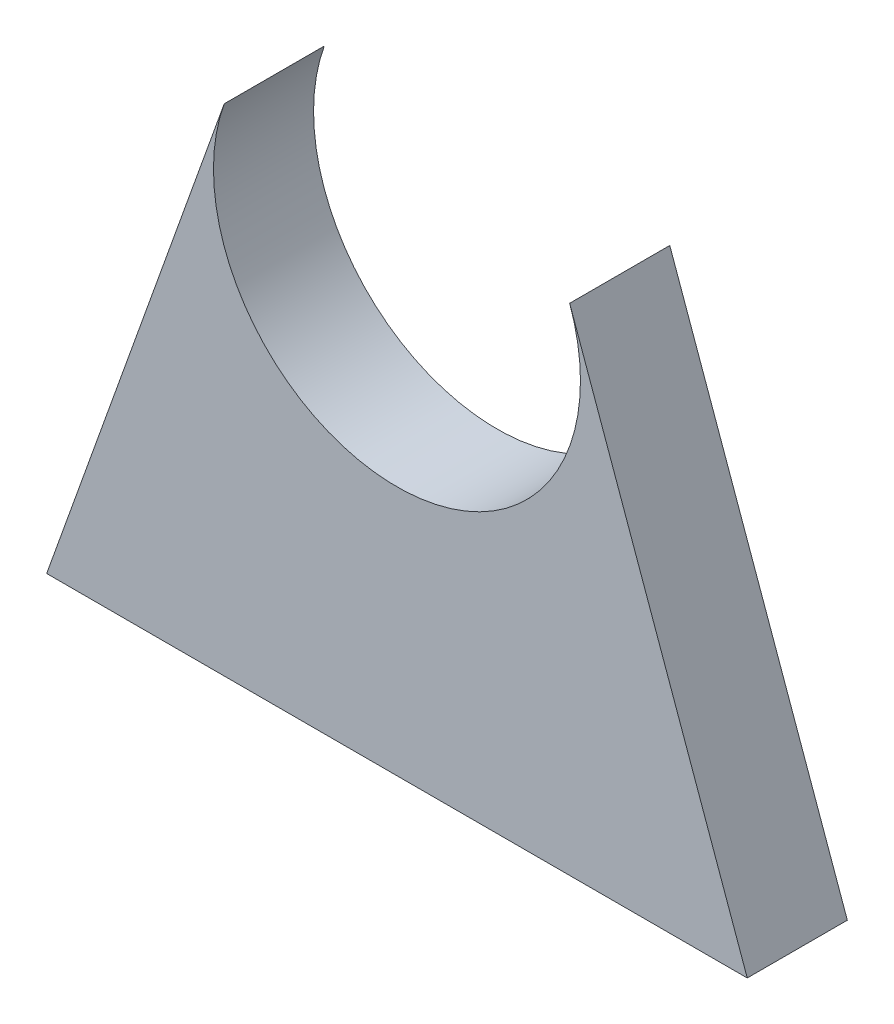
from build123d import *

# Parameters (mm, degrees)
EXTRUDE_1_DEPTH = 6


with BuildPart() as part:
    # Sketch 4 → Extrude 1 (new body)
    with BuildSketch(Plane.XY):
        with BuildLine():
            Line((-10.355423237, 35.710149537), (-21, 6))
            Line((-21, 6), (21, 6))
            Line((21, 6), (10.355423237, 35.710149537))
            ThreePointArc((10.355423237, 35.710149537), (0, 21), (-10.355423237, 35.710149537))
        make_face()
    extrude(amount=EXTRUDE_1_DEPTH)


solid = part.part
